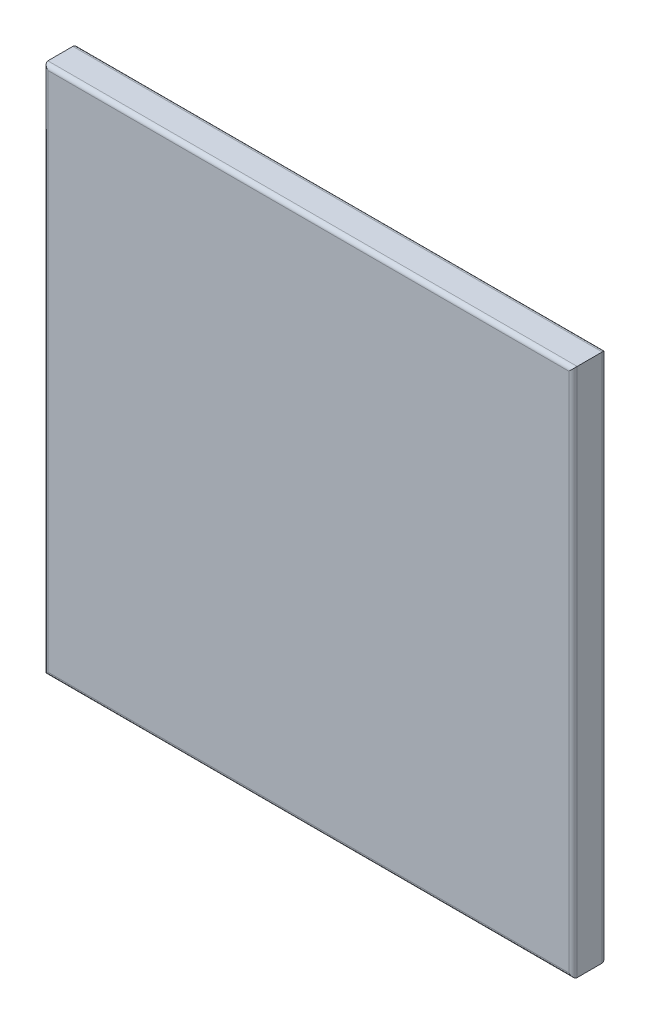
ISO-10303-21;
HEADER;
FILE_DESCRIPTION(('STEP AP214'),'2;1');
FILE_NAME('part.step','',(''),(''),'','','');
FILE_SCHEMA(('AUTOMOTIVE_DESIGN { 1 0 10303 214 1 1 1 1 }'));
ENDSEC;
DATA;
#1=APPLICATION_CONTEXT('core data for automotive mechanical design processes');
#2=APPLICATION_PROTOCOL_DEFINITION('international standard','automotive_design',2000,#1);
#3=PRODUCT_CONTEXT('',#1,'mechanical');
#4=PRODUCT('Part','Part','',(#3));
#5=PRODUCT_RELATED_PRODUCT_CATEGORY('part','',(#4));
#6=PRODUCT_DEFINITION_FORMATION('','',#4);
#7=PRODUCT_DEFINITION_CONTEXT('part definition',#1,'design');
#8=PRODUCT_DEFINITION('design','',#6,#7);
#9=PRODUCT_DEFINITION_SHAPE('','',#8);
#10=(LENGTH_UNIT() NAMED_UNIT(*) SI_UNIT(.MILLI.,.METRE.));
#11=(NAMED_UNIT(*) PLANE_ANGLE_UNIT() SI_UNIT($,.RADIAN.));
#12=(NAMED_UNIT(*) SI_UNIT($,.STERADIAN.) SOLID_ANGLE_UNIT());
#13=UNCERTAINTY_MEASURE_WITH_UNIT(LENGTH_MEASURE(1.E-05),#10,'distance_accuracy_value','');
#14=(GEOMETRIC_REPRESENTATION_CONTEXT(3) GLOBAL_UNCERTAINTY_ASSIGNED_CONTEXT((#13)) GLOBAL_UNIT_ASSIGNED_CONTEXT((#10,
#11,#12)) REPRESENTATION_CONTEXT('',''));
#15=CARTESIAN_POINT('',(0.,0.,0.));
#16=DIRECTION('',(0.,0.,1.));
#17=DIRECTION('',(1.,0.,0.));
#18=AXIS2_PLACEMENT_3D('',#15,#16,#17);
#19=CARTESIAN_POINT('',(15.9,-15.9,2.));
#20=DIRECTION('',(-1.,0.,0.));
#21=DIRECTION('',(0.,0.,1.));
#22=AXIS2_PLACEMENT_3D('',#19,#20,#21);
#23=PLANE('',#22);
#24=DIRECTION('',(0.,0.,-1.));
#25=VECTOR('',#24,1.);
#26=CARTESIAN_POINT('',(15.9,-15.9,2.));
#27=LINE('',#26,#25);
#28=CARTESIAN_POINT('',(15.9,-15.9,1.75));
#29=VERTEX_POINT('',#28);
#30=CARTESIAN_POINT('',(15.9,-15.9,0.25));
#31=VERTEX_POINT('',#30);
#32=EDGE_CURVE('E158',#29,#31,#27,.T.);
#33=ORIENTED_EDGE('',*,*,#32,.T.);
#34=DIRECTION('',(0.,1.,0.));
#35=VECTOR('',#34,1.);
#36=CARTESIAN_POINT('',(15.9,15.9,0.25));
#37=LINE('',#36,#35);
#38=CARTESIAN_POINT('',(15.9,15.9,0.25));
#39=VERTEX_POINT('',#38);
#40=EDGE_CURVE('E172',#31,#39,#37,.T.);
#41=ORIENTED_EDGE('',*,*,#40,.T.);
#42=DIRECTION('',(0.,0.,-1.));
#43=VECTOR('',#42,1.);
#44=CARTESIAN_POINT('',(15.9,15.9,2.));
#45=LINE('',#44,#43);
#46=CARTESIAN_POINT('',(15.9,15.9,1.75));
#47=VERTEX_POINT('',#46);
#48=EDGE_CURVE('E129',#47,#39,#45,.T.);
#49=ORIENTED_EDGE('',*,*,#48,.F.);
#50=DIRECTION('',(0.,1.,0.));
#51=VECTOR('',#50,1.);
#52=CARTESIAN_POINT('',(15.9,-15.9,1.75));
#53=LINE('',#52,#51);
#54=EDGE_CURVE('E175',#47,#29,#53,.F.);
#55=ORIENTED_EDGE('',*,*,#54,.T.);
#56=EDGE_LOOP('',(#33,#41,#49,#55));
#57=FACE_BOUND('',#56,.T.);
#58=ADVANCED_FACE('F39',(#57),#23,.F.);
#59=CARTESIAN_POINT('',(-15.9,15.9,2.));
#60=DIRECTION('',(0.,-1.,0.));
#61=DIRECTION('',(0.,0.,-1.));
#62=AXIS2_PLACEMENT_3D('',#59,#60,#61);
#63=PLANE('',#62);
#64=ORIENTED_EDGE('',*,*,#48,.T.);
#65=DIRECTION('',(-1.,0.,0.));
#66=VECTOR('',#65,1.);
#67=CARTESIAN_POINT('',(-15.9,15.9,0.25));
#68=LINE('',#67,#66);
#69=CARTESIAN_POINT('',(-15.9,15.9,0.25));
#70=VERTEX_POINT('',#69);
#71=EDGE_CURVE('E127',#39,#70,#68,.T.);
#72=ORIENTED_EDGE('',*,*,#71,.T.);
#73=DIRECTION('',(0.,0.,-1.));
#74=VECTOR('',#73,1.);
#75=CARTESIAN_POINT('',(-15.9,15.9,2.));
#76=LINE('',#75,#74);
#77=CARTESIAN_POINT('',(-15.9,15.9,1.75));
#78=VERTEX_POINT('',#77);
#79=EDGE_CURVE('E109',#78,#70,#76,.T.);
#80=ORIENTED_EDGE('',*,*,#79,.F.);
#81=DIRECTION('',(-1.,0.,0.));
#82=VECTOR('',#81,1.);
#83=CARTESIAN_POINT('',(-15.9,15.9,1.75));
#84=LINE('',#83,#82);
#85=EDGE_CURVE('E124',#78,#47,#84,.F.);
#86=ORIENTED_EDGE('',*,*,#85,.T.);
#87=EDGE_LOOP('',(#64,#72,#80,#86));
#88=FACE_BOUND('',#87,.T.);
#89=ADVANCED_FACE('F123',(#88),#63,.F.);
#90=CARTESIAN_POINT('',(-15.9,-15.9,2.));
#91=DIRECTION('',(1.,0.,0.));
#92=DIRECTION('',(0.,0.,-1.));
#93=AXIS2_PLACEMENT_3D('',#90,#91,#92);
#94=PLANE('',#93);
#95=ORIENTED_EDGE('',*,*,#79,.T.);
#96=DIRECTION('',(0.,-1.,0.));
#97=VECTOR('',#96,1.);
#98=CARTESIAN_POINT('',(-15.9,-15.9,0.25));
#99=LINE('',#98,#97);
#100=CARTESIAN_POINT('',(-15.9,-15.9,0.25));
#101=VERTEX_POINT('',#100);
#102=EDGE_CURVE('E116',#70,#101,#99,.T.);
#103=ORIENTED_EDGE('',*,*,#102,.T.);
#104=DIRECTION('',(0.,0.,-1.));
#105=VECTOR('',#104,1.);
#106=CARTESIAN_POINT('',(-15.9,-15.9,2.));
#107=LINE('',#106,#105);
#108=CARTESIAN_POINT('',(-15.9,-15.9,1.75));
#109=VERTEX_POINT('',#108);
#110=EDGE_CURVE('E111',#109,#101,#107,.T.);
#111=ORIENTED_EDGE('',*,*,#110,.F.);
#112=DIRECTION('',(0.,-1.,0.));
#113=VECTOR('',#112,1.);
#114=CARTESIAN_POINT('',(-15.9,-15.9,1.75));
#115=LINE('',#114,#113);
#116=EDGE_CURVE('E106',#109,#78,#115,.F.);
#117=ORIENTED_EDGE('',*,*,#116,.T.);
#118=EDGE_LOOP('',(#95,#103,#111,#117));
#119=FACE_BOUND('',#118,.T.);
#120=ADVANCED_FACE('F108',(#119),#94,.F.);
#121=CARTESIAN_POINT('',(-15.9,-15.9,2.));
#122=DIRECTION('',(0.,1.,0.));
#123=DIRECTION('',(0.,0.,1.));
#124=AXIS2_PLACEMENT_3D('',#121,#122,#123);
#125=PLANE('',#124);
#126=ORIENTED_EDGE('',*,*,#110,.T.);
#127=DIRECTION('',(1.,0.,0.));
#128=VECTOR('',#127,1.);
#129=CARTESIAN_POINT('',(15.9,-15.9,0.25));
#130=LINE('',#129,#128);
#131=EDGE_CURVE('E178',#101,#31,#130,.T.);
#132=ORIENTED_EDGE('',*,*,#131,.T.);
#133=ORIENTED_EDGE('',*,*,#32,.F.);
#134=DIRECTION('',(1.,0.,0.));
#135=VECTOR('',#134,1.);
#136=CARTESIAN_POINT('',(-15.9,-15.9,1.75));
#137=LINE('',#136,#135);
#138=EDGE_CURVE('E181',#29,#109,#137,.F.);
#139=ORIENTED_EDGE('',*,*,#138,.T.);
#140=EDGE_LOOP('',(#126,#132,#133,#139));
#141=FACE_BOUND('',#140,.T.);
#142=ADVANCED_FACE('F229',(#141),#125,.F.);
#143=CARTESIAN_POINT('',(0.,0.,2.));
#144=DIRECTION('',(0.,0.,-1.));
#145=DIRECTION('',(-1.,0.,0.));
#146=AXIS2_PLACEMENT_3D('',#143,#144,#145);
#147=PLANE('',#146);
#148=DIRECTION('',(0.,-1.,0.));
#149=VECTOR('',#148,1.);
#150=CARTESIAN_POINT('',(-15.65,0.,2.));
#151=LINE('',#150,#149);
#152=CARTESIAN_POINT('',(-15.65,15.65,2.));
#153=VERTEX_POINT('',#152);
#154=CARTESIAN_POINT('',(-15.65,-15.65,2.));
#155=VERTEX_POINT('',#154);
#156=EDGE_CURVE('E49',#153,#155,#151,.T.);
#157=ORIENTED_EDGE('',*,*,#156,.T.);
#158=DIRECTION('',(1.,0.,0.));
#159=VECTOR('',#158,1.);
#160=CARTESIAN_POINT('',(0.,-15.65,2.));
#161=LINE('',#160,#159);
#162=CARTESIAN_POINT('',(15.65,-15.65,2.));
#163=VERTEX_POINT('',#162);
#164=EDGE_CURVE('E11',#155,#163,#161,.T.);
#165=ORIENTED_EDGE('',*,*,#164,.T.);
#166=DIRECTION('',(0.,1.,0.));
#167=VECTOR('',#166,1.);
#168=CARTESIAN_POINT('',(15.65,0.,2.));
#169=LINE('',#168,#167);
#170=CARTESIAN_POINT('',(15.65,15.65,2.));
#171=VERTEX_POINT('',#170);
#172=EDGE_CURVE('E169',#163,#171,#169,.T.);
#173=ORIENTED_EDGE('',*,*,#172,.T.);
#174=DIRECTION('',(-1.,0.,0.));
#175=VECTOR('',#174,1.);
#176=CARTESIAN_POINT('',(0.,15.65,2.));
#177=LINE('',#176,#175);
#178=EDGE_CURVE('E60',#171,#153,#177,.T.);
#179=ORIENTED_EDGE('',*,*,#178,.T.);
#180=EDGE_LOOP('',(#157,#165,#173,#179));
#181=FACE_BOUND('',#180,.T.);
#182=ADVANCED_FACE('F235',(#181),#147,.F.);
#183=CARTESIAN_POINT('',(0.,0.,0.));
#184=DIRECTION('',(0.,0.,-1.));
#185=DIRECTION('',(-1.,0.,0.));
#186=AXIS2_PLACEMENT_3D('',#183,#184,#185);
#187=PLANE('',#186);
#188=DIRECTION('',(0.,-1.,0.));
#189=VECTOR('',#188,1.);
#190=CARTESIAN_POINT('',(-15.65,15.9,0.));
#191=LINE('',#190,#189);
#192=CARTESIAN_POINT('',(-15.65,-15.65,0.));
#193=VERTEX_POINT('',#192);
#194=CARTESIAN_POINT('',(-15.65,15.65,0.));
#195=VERTEX_POINT('',#194);
#196=EDGE_CURVE('E189',#193,#195,#191,.F.);
#197=ORIENTED_EDGE('',*,*,#196,.T.);
#198=DIRECTION('',(-1.,0.,0.));
#199=VECTOR('',#198,1.);
#200=CARTESIAN_POINT('',(15.9,15.65,0.));
#201=LINE('',#200,#199);
#202=CARTESIAN_POINT('',(15.65,15.65,0.));
#203=VERTEX_POINT('',#202);
#204=EDGE_CURVE('E117',#195,#203,#201,.F.);
#205=ORIENTED_EDGE('',*,*,#204,.T.);
#206=DIRECTION('',(0.,1.,0.));
#207=VECTOR('',#206,1.);
#208=CARTESIAN_POINT('',(15.65,-15.9,0.));
#209=LINE('',#208,#207);
#210=CARTESIAN_POINT('',(15.65,-15.65,0.));
#211=VERTEX_POINT('',#210);
#212=EDGE_CURVE('E195',#203,#211,#209,.F.);
#213=ORIENTED_EDGE('',*,*,#212,.T.);
#214=DIRECTION('',(1.,0.,0.));
#215=VECTOR('',#214,1.);
#216=CARTESIAN_POINT('',(-15.9,-15.65,0.));
#217=LINE('',#216,#215);
#218=EDGE_CURVE('E192',#211,#193,#217,.F.);
#219=ORIENTED_EDGE('',*,*,#218,.T.);
#220=EDGE_LOOP('',(#197,#205,#213,#219));
#221=FACE_BOUND('',#220,.T.);
#222=ADVANCED_FACE('F237',(#221),#187,.T.);
#223=CARTESIAN_POINT('',(-15.9,-15.65,0.25));
#224=DIRECTION('',(-1.,0.,0.));
#225=DIRECTION('',(0.,0.,1.));
#226=AXIS2_PLACEMENT_3D('',#223,#224,#225);
#227=CYLINDRICAL_SURFACE('',#226,0.25);
#228=CARTESIAN_POINT('',(-15.65,-15.65,0.25));
#229=DIRECTION('',(-0.707106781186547,0.707106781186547,0.));
#230=DIRECTION('',(-0.707106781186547,-0.707106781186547,0.));
#231=AXIS2_PLACEMENT_3D('',#228,#229,#230);
#232=ELLIPSE('',#231,0.353553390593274,0.25);
#233=EDGE_CURVE('E159',#193,#101,#232,.T.);
#234=ORIENTED_EDGE('',*,*,#233,.F.);
#235=ORIENTED_EDGE('',*,*,#218,.F.);
#236=CARTESIAN_POINT('',(15.65,-15.65,0.25));
#237=DIRECTION('',(-0.707106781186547,-0.707106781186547,0.));
#238=DIRECTION('',(0.707106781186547,-0.707106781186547,0.));
#239=AXIS2_PLACEMENT_3D('',#236,#237,#238);
#240=ELLIPSE('',#239,0.353553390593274,0.25);
#241=EDGE_CURVE('E154',#31,#211,#240,.F.);
#242=ORIENTED_EDGE('',*,*,#241,.F.);
#243=ORIENTED_EDGE('',*,*,#131,.F.);
#244=EDGE_LOOP('',(#234,#235,#242,#243));
#245=FACE_BOUND('',#244,.T.);
#246=ADVANCED_FACE('F216',(#245),#227,.T.);
#247=CARTESIAN_POINT('',(15.65,-15.9,0.25));
#248=DIRECTION('',(0.,-1.,0.));
#249=DIRECTION('',(0.,0.,-1.));
#250=AXIS2_PLACEMENT_3D('',#247,#248,#249);
#251=CYLINDRICAL_SURFACE('',#250,0.25);
#252=ORIENTED_EDGE('',*,*,#241,.T.);
#253=ORIENTED_EDGE('',*,*,#212,.F.);
#254=CARTESIAN_POINT('',(15.65,15.65,0.25));
#255=DIRECTION('',(0.707106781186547,-0.707106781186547,0.));
#256=DIRECTION('',(-0.707106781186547,-0.707106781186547,0.));
#257=AXIS2_PLACEMENT_3D('',#254,#255,#256);
#258=ELLIPSE('',#257,0.353553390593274,0.25);
#259=EDGE_CURVE('E143',#39,#203,#258,.F.);
#260=ORIENTED_EDGE('',*,*,#259,.F.);
#261=ORIENTED_EDGE('',*,*,#40,.F.);
#262=EDGE_LOOP('',(#252,#253,#260,#261));
#263=FACE_BOUND('',#262,.T.);
#264=ADVANCED_FACE('F220',(#263),#251,.T.);
#265=CARTESIAN_POINT('',(-15.65,-15.9,0.25));
#266=DIRECTION('',(0.,1.,0.));
#267=DIRECTION('',(0.,0.,1.));
#268=AXIS2_PLACEMENT_3D('',#265,#266,#267);
#269=CYLINDRICAL_SURFACE('',#268,0.25);
#270=ORIENTED_EDGE('',*,*,#233,.T.);
#271=ORIENTED_EDGE('',*,*,#102,.F.);
#272=CARTESIAN_POINT('',(-15.65,15.65,0.25));
#273=DIRECTION('',(0.707106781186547,0.707106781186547,0.));
#274=DIRECTION('',(-0.707106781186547,0.707106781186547,0.));
#275=AXIS2_PLACEMENT_3D('',#272,#273,#274);
#276=ELLIPSE('',#275,0.353553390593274,0.25);
#277=EDGE_CURVE('E140',#195,#70,#276,.T.);
#278=ORIENTED_EDGE('',*,*,#277,.F.);
#279=ORIENTED_EDGE('',*,*,#196,.F.);
#280=EDGE_LOOP('',(#270,#271,#278,#279));
#281=FACE_BOUND('',#280,.T.);
#282=ADVANCED_FACE('F228',(#281),#269,.T.);
#283=CARTESIAN_POINT('',(-15.9,15.65,0.25));
#284=DIRECTION('',(1.,0.,0.));
#285=DIRECTION('',(0.,0.,-1.));
#286=AXIS2_PLACEMENT_3D('',#283,#284,#285);
#287=CYLINDRICAL_SURFACE('',#286,0.25);
#288=ORIENTED_EDGE('',*,*,#259,.T.);
#289=ORIENTED_EDGE('',*,*,#204,.F.);
#290=ORIENTED_EDGE('',*,*,#277,.T.);
#291=ORIENTED_EDGE('',*,*,#71,.F.);
#292=EDGE_LOOP('',(#288,#289,#290,#291));
#293=FACE_BOUND('',#292,.T.);
#294=ADVANCED_FACE('F223',(#293),#287,.T.);
#295=CARTESIAN_POINT('',(0.,15.65,1.75));
#296=DIRECTION('',(-1.,0.,0.));
#297=DIRECTION('',(0.,0.,1.));
#298=AXIS2_PLACEMENT_3D('',#295,#296,#297);
#299=CYLINDRICAL_SURFACE('',#298,0.25);
#300=CARTESIAN_POINT('',(15.65,15.65,1.75));
#301=DIRECTION('',(-0.707106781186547,0.707106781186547,0.));
#302=DIRECTION('',(0.707106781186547,0.707106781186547,0.));
#303=AXIS2_PLACEMENT_3D('',#300,#301,#302);
#304=ELLIPSE('',#303,0.353553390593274,0.25);
#305=EDGE_CURVE('E134',#47,#171,#304,.F.);
#306=ORIENTED_EDGE('',*,*,#305,.F.);
#307=ORIENTED_EDGE('',*,*,#85,.F.);
#308=CARTESIAN_POINT('',(-15.65,15.65,1.75));
#309=DIRECTION('',(-0.707106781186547,-0.707106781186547,0.));
#310=DIRECTION('',(-0.707106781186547,0.707106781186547,0.));
#311=AXIS2_PLACEMENT_3D('',#308,#309,#310);
#312=ELLIPSE('',#311,0.353553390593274,0.25);
#313=EDGE_CURVE('E43',#153,#78,#312,.T.);
#314=ORIENTED_EDGE('',*,*,#313,.F.);
#315=ORIENTED_EDGE('',*,*,#178,.F.);
#316=EDGE_LOOP('',(#306,#307,#314,#315));
#317=FACE_BOUND('',#316,.T.);
#318=ADVANCED_FACE('F41',(#317),#299,.T.);
#319=CARTESIAN_POINT('',(-15.65,0.,1.75));
#320=DIRECTION('',(0.,-1.,0.));
#321=DIRECTION('',(0.,0.,-1.));
#322=AXIS2_PLACEMENT_3D('',#319,#320,#321);
#323=CYLINDRICAL_SURFACE('',#322,0.25);
#324=ORIENTED_EDGE('',*,*,#313,.T.);
#325=ORIENTED_EDGE('',*,*,#116,.F.);
#326=CARTESIAN_POINT('',(-15.65,-15.65,1.75));
#327=DIRECTION('',(0.707106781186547,-0.707106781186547,0.));
#328=DIRECTION('',(-0.707106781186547,-0.707106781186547,0.));
#329=AXIS2_PLACEMENT_3D('',#326,#327,#328);
#330=ELLIPSE('',#329,0.353553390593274,0.25);
#331=EDGE_CURVE('E145',#155,#109,#330,.T.);
#332=ORIENTED_EDGE('',*,*,#331,.F.);
#333=ORIENTED_EDGE('',*,*,#156,.F.);
#334=EDGE_LOOP('',(#324,#325,#332,#333));
#335=FACE_BOUND('',#334,.T.);
#336=ADVANCED_FACE('F138',(#335),#323,.T.);
#337=CARTESIAN_POINT('',(15.65,0.,1.75));
#338=DIRECTION('',(0.,1.,0.));
#339=DIRECTION('',(0.,0.,1.));
#340=AXIS2_PLACEMENT_3D('',#337,#338,#339);
#341=CYLINDRICAL_SURFACE('',#340,0.25);
#342=ORIENTED_EDGE('',*,*,#305,.T.);
#343=ORIENTED_EDGE('',*,*,#172,.F.);
#344=CARTESIAN_POINT('',(15.65,-15.65,1.75));
#345=DIRECTION('',(0.707106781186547,0.707106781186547,0.));
#346=DIRECTION('',(-0.707106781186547,0.707106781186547,0.));
#347=AXIS2_PLACEMENT_3D('',#344,#345,#346);
#348=ELLIPSE('',#347,0.353553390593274,0.25);
#349=EDGE_CURVE('E149',#29,#163,#348,.F.);
#350=ORIENTED_EDGE('',*,*,#349,.F.);
#351=ORIENTED_EDGE('',*,*,#54,.F.);
#352=EDGE_LOOP('',(#342,#343,#350,#351));
#353=FACE_BOUND('',#352,.T.);
#354=ADVANCED_FACE('F234',(#353),#341,.T.);
#355=CARTESIAN_POINT('',(0.,-15.65,1.75));
#356=DIRECTION('',(1.,0.,0.));
#357=DIRECTION('',(0.,0.,-1.));
#358=AXIS2_PLACEMENT_3D('',#355,#356,#357);
#359=CYLINDRICAL_SURFACE('',#358,0.25);
#360=ORIENTED_EDGE('',*,*,#331,.T.);
#361=ORIENTED_EDGE('',*,*,#138,.F.);
#362=ORIENTED_EDGE('',*,*,#349,.T.);
#363=ORIENTED_EDGE('',*,*,#164,.F.);
#364=EDGE_LOOP('',(#360,#361,#362,#363));
#365=FACE_BOUND('',#364,.T.);
#366=ADVANCED_FACE('F232',(#365),#359,.T.);
#367=CLOSED_SHELL('',(#58,#89,#120,#142,#182,#222,#246,#264,#282,#294,#318,#336,#354,#366));
#368=MANIFOLD_SOLID_BREP('B2',#367);
#369=ADVANCED_BREP_SHAPE_REPRESENTATION('',(#18,#368),#14);
#370=SHAPE_DEFINITION_REPRESENTATION(#9,#369);
ENDSEC;
END-ISO-10303-21;
